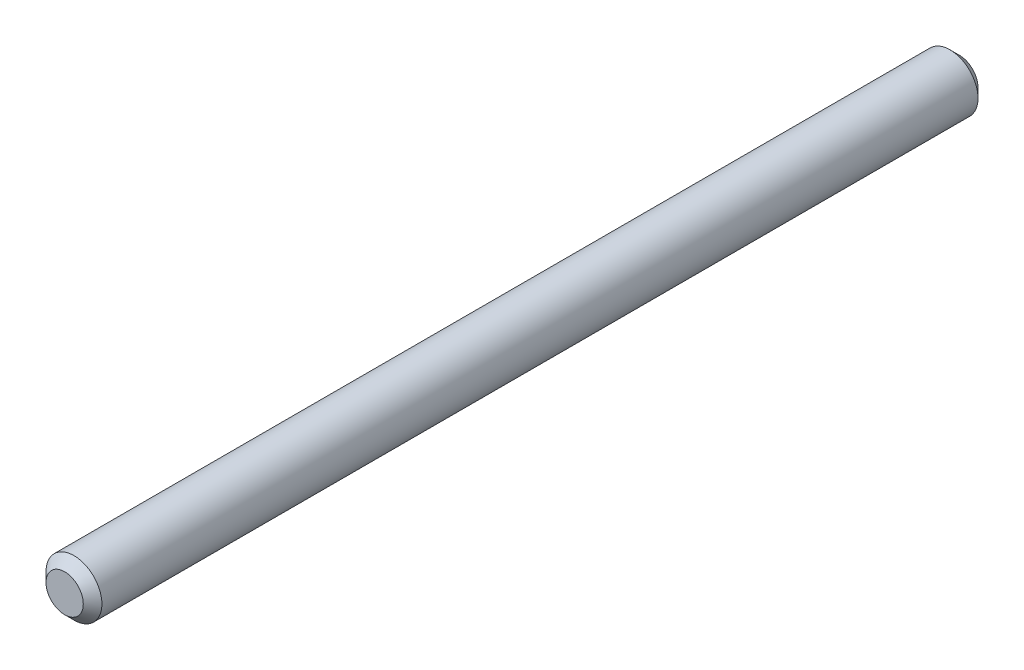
from build123d import *

# Parameters (mm, degrees)
ESQUISSE1_R      = 1.5
EXTRUSION1_DEPTH = 48
CHANFREIN1_SIZE  = 0.5


with BuildPart() as part:
    # Esquisse1 → Extrusion1 (new body)
    with BuildSketch(Plane.XY):
        Circle(ESQUISSE1_R)
    extrude(amount=EXTRUSION1_DEPTH)

    # Chanfrein1
    chanfrein1_edges = [part.edges().sort_by_distance(p)[0] for p in [
        (-1.5, 0, 0),
        (-1.5, 0, 48),
    ]]
    chamfer(chanfrein1_edges, length=CHANFREIN1_SIZE)


solid = part.part
